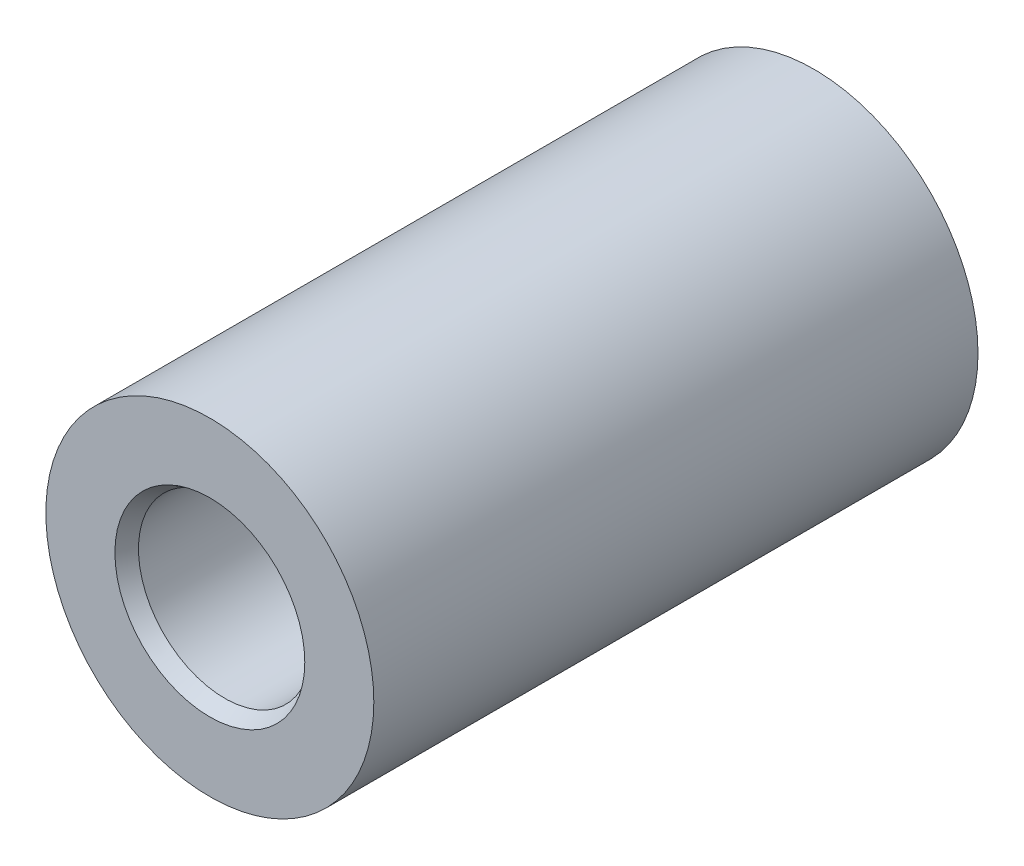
ISO-10303-21;
HEADER;
FILE_DESCRIPTION(('STEP AP214'),'2;1');
FILE_NAME('part.step','',(''),(''),'','','');
FILE_SCHEMA(('AUTOMOTIVE_DESIGN { 1 0 10303 214 1 1 1 1 }'));
ENDSEC;
DATA;
#1=APPLICATION_CONTEXT('core data for automotive mechanical design processes');
#2=APPLICATION_PROTOCOL_DEFINITION('international standard','automotive_design',2000,#1);
#3=PRODUCT_CONTEXT('',#1,'mechanical');
#4=PRODUCT('Part','Part','',(#3));
#5=PRODUCT_RELATED_PRODUCT_CATEGORY('part','',(#4));
#6=PRODUCT_DEFINITION_FORMATION('','',#4);
#7=PRODUCT_DEFINITION_CONTEXT('part definition',#1,'design');
#8=PRODUCT_DEFINITION('design','',#6,#7);
#9=PRODUCT_DEFINITION_SHAPE('','',#8);
#10=(LENGTH_UNIT() NAMED_UNIT(*) SI_UNIT(.MILLI.,.METRE.));
#11=(NAMED_UNIT(*) PLANE_ANGLE_UNIT() SI_UNIT($,.RADIAN.));
#12=(NAMED_UNIT(*) SI_UNIT($,.STERADIAN.) SOLID_ANGLE_UNIT());
#13=UNCERTAINTY_MEASURE_WITH_UNIT(LENGTH_MEASURE(1.E-05),#10,'distance_accuracy_value','');
#14=(GEOMETRIC_REPRESENTATION_CONTEXT(3) GLOBAL_UNCERTAINTY_ASSIGNED_CONTEXT((#13)) GLOBAL_UNIT_ASSIGNED_CONTEXT((#10,
#11,#12)) REPRESENTATION_CONTEXT('',''));
#15=CARTESIAN_POINT('',(0.,0.,0.));
#16=DIRECTION('',(0.,0.,1.));
#17=DIRECTION('',(1.,0.,0.));
#18=AXIS2_PLACEMENT_3D('',#15,#16,#17);
#19=CARTESIAN_POINT('',(0.,0.,35.));
#20=DIRECTION('',(0.,0.,-1.));
#21=DIRECTION('',(-1.,0.,0.));
#22=AXIS2_PLACEMENT_3D('',#19,#20,#21);
#23=CYLINDRICAL_SURFACE('',#22,9.5);
#24=CARTESIAN_POINT('',(0.,0.,35.));
#25=DIRECTION('',(0.,0.,1.));
#26=DIRECTION('',(1.,0.,0.));
#27=AXIS2_PLACEMENT_3D('',#24,#25,#26);
#28=CIRCLE('',#27,9.5);
#29=CARTESIAN_POINT('',(9.5,0.,35.));
#30=VERTEX_POINT('',#29);
#31=EDGE_CURVE('E8',#30,#30,#28,.T.);
#32=ORIENTED_EDGE('',*,*,#31,.F.);
#33=EDGE_LOOP('',(#32));
#34=FACE_BOUND('',#33,.T.);
#35=CARTESIAN_POINT('',(0.,0.,0.));
#36=DIRECTION('',(0.,0.,1.));
#37=DIRECTION('',(1.,0.,0.));
#38=AXIS2_PLACEMENT_3D('',#35,#36,#37);
#39=CIRCLE('',#38,9.5);
#40=CARTESIAN_POINT('',(9.5,0.,0.));
#41=VERTEX_POINT('',#40);
#42=EDGE_CURVE('E19',#41,#41,#39,.T.);
#43=ORIENTED_EDGE('',*,*,#42,.T.);
#44=EDGE_LOOP('',(#43));
#45=FACE_BOUND('',#44,.T.);
#46=ADVANCED_FACE('F12',(#34,#45),#23,.T.);
#47=CARTESIAN_POINT('',(0.,0.,35.));
#48=DIRECTION('',(0.,0.,1.));
#49=DIRECTION('',(1.,0.,0.));
#50=AXIS2_PLACEMENT_3D('',#47,#48,#49);
#51=PLANE('',#50);
#52=ORIENTED_EDGE('',*,*,#31,.T.);
#53=EDGE_LOOP('',(#52));
#54=FACE_BOUND('',#53,.T.);
#55=CARTESIAN_POINT('',(0.,0.,35.));
#56=DIRECTION('',(0.,0.,1.));
#57=DIRECTION('',(1.,0.,0.));
#58=AXIS2_PLACEMENT_3D('',#55,#56,#57);
#59=CIRCLE('',#58,5.5);
#60=CARTESIAN_POINT('',(5.5,0.,35.));
#61=VERTEX_POINT('',#60);
#62=EDGE_CURVE('E23',#61,#61,#59,.T.);
#63=ORIENTED_EDGE('',*,*,#62,.F.);
#64=EDGE_LOOP('',(#63));
#65=FACE_BOUND('',#64,.T.);
#66=ADVANCED_FACE('F53',(#54,#65),#51,.T.);
#67=CARTESIAN_POINT('',(0.,0.,0.));
#68=DIRECTION('',(0.,0.,1.));
#69=DIRECTION('',(1.,0.,0.));
#70=AXIS2_PLACEMENT_3D('',#67,#68,#69);
#71=PLANE('',#70);
#72=ORIENTED_EDGE('',*,*,#42,.F.);
#73=EDGE_LOOP('',(#72));
#74=FACE_BOUND('',#73,.T.);
#75=ADVANCED_FACE('F50',(#74),#71,.F.);
#76=CARTESIAN_POINT('',(0.,0.,35.));
#77=DIRECTION('',(0.,0.,1.));
#78=DIRECTION('',(1.,0.,0.));
#79=AXIS2_PLACEMENT_3D('',#76,#77,#78);
#80=CONICAL_SURFACE('',#79,5.5,0.523598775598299);
#81=CARTESIAN_POINT('',(0.,0.,34.1339745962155));
#82=DIRECTION('',(0.,0.,1.));
#83=DIRECTION('',(1.,0.,0.));
#84=AXIS2_PLACEMENT_3D('',#81,#82,#83);
#85=CIRCLE('',#84,5.);
#86=CARTESIAN_POINT('',(5.,0.,34.1339745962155));
#87=VERTEX_POINT('',#86);
#88=EDGE_CURVE('E15',#87,#87,#85,.F.);
#89=ORIENTED_EDGE('',*,*,#88,.T.);
#90=EDGE_LOOP('',(#89));
#91=FACE_BOUND('',#90,.T.);
#92=ORIENTED_EDGE('',*,*,#62,.T.);
#93=EDGE_LOOP('',(#92));
#94=FACE_BOUND('',#93,.T.);
#95=ADVANCED_FACE('F35',(#91,#94),#80,.F.);
#96=CARTESIAN_POINT('',(0.,0.,20.));
#97=DIRECTION('',(0.,0.,1.));
#98=DIRECTION('',(1.,0.,0.));
#99=AXIS2_PLACEMENT_3D('',#96,#97,#98);
#100=CYLINDRICAL_SURFACE('',#99,5.);
#101=CARTESIAN_POINT('',(0.,0.,20.));
#102=DIRECTION('',(0.,0.,1.));
#103=DIRECTION('',(1.,0.,0.));
#104=AXIS2_PLACEMENT_3D('',#101,#102,#103);
#105=CIRCLE('',#104,5.);
#106=CARTESIAN_POINT('',(5.,0.,20.));
#107=VERTEX_POINT('',#106);
#108=EDGE_CURVE('E28',#107,#107,#105,.T.);
#109=ORIENTED_EDGE('',*,*,#108,.F.);
#110=EDGE_LOOP('',(#109));
#111=FACE_BOUND('',#110,.T.);
#112=ORIENTED_EDGE('',*,*,#88,.F.);
#113=EDGE_LOOP('',(#112));
#114=FACE_BOUND('',#113,.T.);
#115=ADVANCED_FACE('F38',(#111,#114),#100,.F.);
#116=CARTESIAN_POINT('',(0.,0.,20.));
#117=DIRECTION('',(0.,0.,1.));
#118=DIRECTION('',(1.,0.,0.));
#119=AXIS2_PLACEMENT_3D('',#116,#117,#118);
#120=PLANE('',#119);
#121=ORIENTED_EDGE('',*,*,#108,.T.);
#122=EDGE_LOOP('',(#121));
#123=FACE_BOUND('',#122,.T.);
#124=ADVANCED_FACE('F40',(#123),#120,.T.);
#125=CLOSED_SHELL('',(#46,#66,#75,#95,#115,#124));
#126=MANIFOLD_SOLID_BREP('B1',#125);
#127=ADVANCED_BREP_SHAPE_REPRESENTATION('',(#18,#126),#14);
#128=SHAPE_DEFINITION_REPRESENTATION(#9,#127);
ENDSEC;
END-ISO-10303-21;
